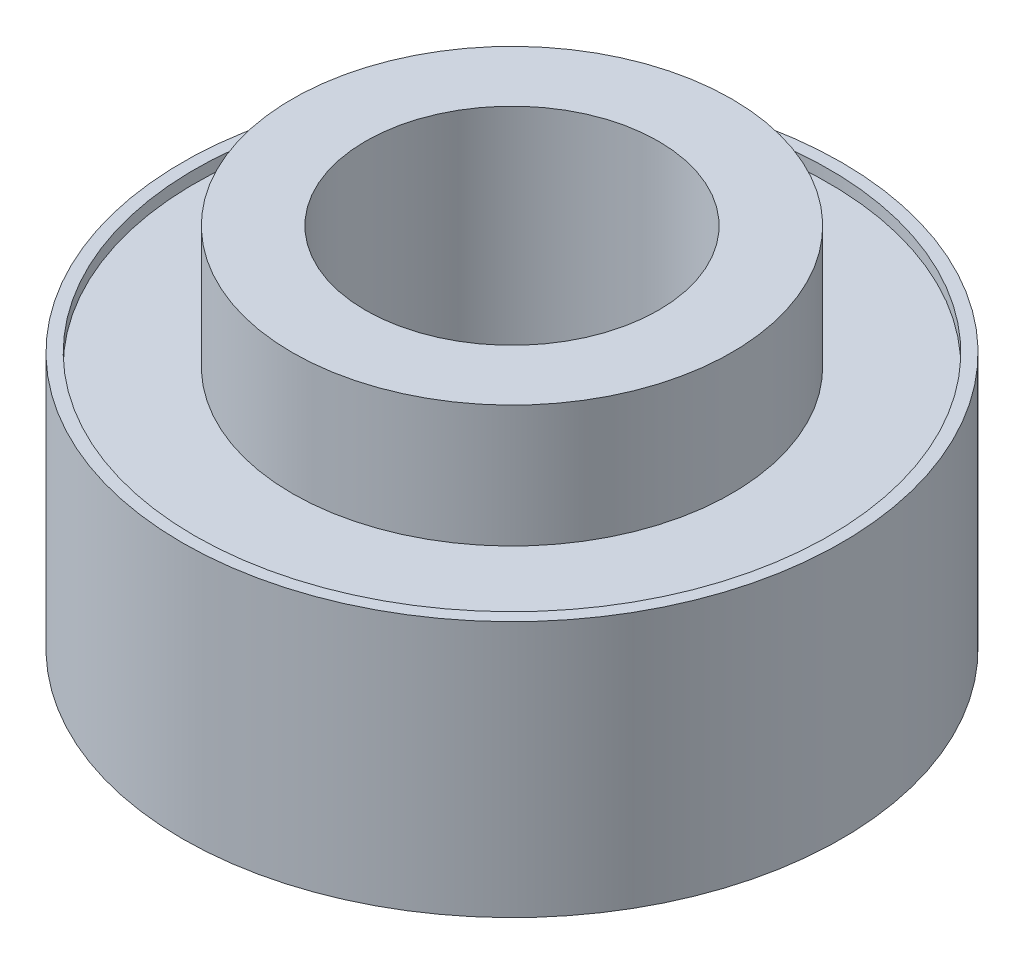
from build123d import *

# Parameters (mm, degrees)
SKETCH_1_R          = 13.5
EXTRUDE_1_DEPTH     = 10.5
SKETCH_2_R          = 13
CUT_EXTRUDE_1_DEPTH = 0.5
CUT_EXTRUDE_START   = -0.5
SKETCH_3_R          = 13
CUT_EXTRUDE_2_DEPTH = 0.5
SKETCH_4_R          = 6
CUT_EXTRUDE_3_DEPTH = 22.552262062
EXTRUDE_START       = 5
SKETCH_5_R          = 9
SKETCH_5_R_2        = 6
EXTRUDE_2_DEPTH     = 5
SKETCH_6_R          = 9
SKETCH_6_R_2        = 6
EXTRUDE_3_DEPTH     = 1.5


with BuildPart() as part:
    # Sketch 1 → Extrude 1 (new body)
    with BuildSketch(Plane(origin=(0, 0, 0), x_dir=(1, 0, 0), z_dir=(0, 1, 0))):
        with Locations(Location((0, 0, 0), (0, 0, 90))):
            Circle(SKETCH_1_R)
    extrude(amount=EXTRUDE_1_DEPTH)

    # Sketch 2 → Cut-Extrude 1 (cut)
    with BuildSketch(Plane(origin=(0, 10.5, 0), x_dir=(1, 0, 0), z_dir=(0, 1, 0))):
        with Locations(Location((0, 0, 0), (0, 0, 270))):
            Circle(SKETCH_2_R)
    extrude(amount=-CUT_EXTRUDE_1_DEPTH, mode=Mode.SUBTRACT)

    # Sketch 3 → Cut-Extrude 2 (cut)
    with BuildSketch(Plane.XZ.offset(CUT_EXTRUDE_START)):
        with Locations(Location((0, 0, 0), (0, 0, 90))):
            Circle(SKETCH_3_R)
    extrude(amount=CUT_EXTRUDE_2_DEPTH, mode=Mode.SUBTRACT)

    # Sketch 4 → Cut-Extrude 3 (cut, through all)
    with BuildSketch(Plane(origin=(0, 10, 0), x_dir=(1, 0, 0), z_dir=(0, 1, 0))):
        with Locations(Location((0, 0, 0), (0, 0, 270))):
            Circle(SKETCH_4_R)
    extrude(amount=-CUT_EXTRUDE_3_DEPTH, mode=Mode.SUBTRACT)

    # Sketch 5 → Extrude 2 (add)
    with BuildSketch(Plane(origin=(0, 10, 0), x_dir=(1, 0, 0), z_dir=(0, 1, 0)).offset(EXTRUDE_START)):
        with Locations(Location((0, 0, 0), (0, 0, 270))):
            Circle(SKETCH_5_R)
        with Locations(Location((0, 0, 0), (0, 0, 270))):
            Circle(SKETCH_5_R_2, mode=Mode.SUBTRACT)
    extrude(amount=-EXTRUDE_2_DEPTH)

    # Sketch 6 → Extrude 3 (add)
    with BuildSketch(Plane.XZ.offset(-0.5)):
        with Locations(Location((0, 0, 0), (0, 0, 90))):
            Circle(SKETCH_6_R)
        with Locations(Location((0, 0, 0), (0, 0, 90))):
            Circle(SKETCH_6_R_2, mode=Mode.SUBTRACT)
    extrude(amount=EXTRUDE_3_DEPTH)


solid = part.part
